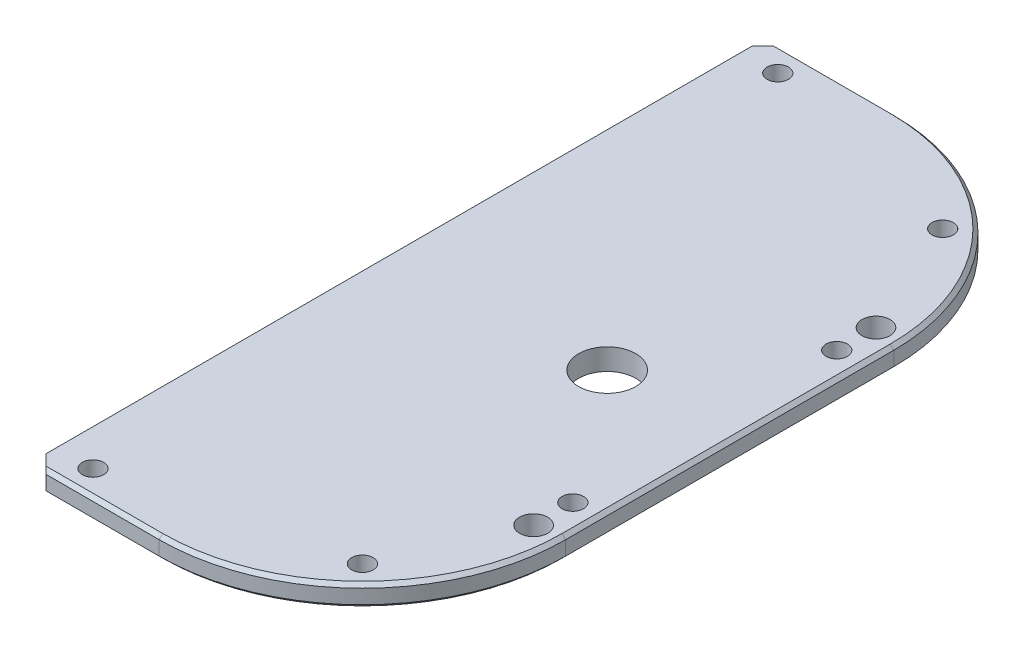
ISO-10303-21;
HEADER;
FILE_DESCRIPTION(('STEP AP214'),'2;1');
FILE_NAME('part.step','',(''),(''),'','','');
FILE_SCHEMA(('AUTOMOTIVE_DESIGN { 1 0 10303 214 1 1 1 1 }'));
ENDSEC;
DATA;
#1=APPLICATION_CONTEXT('core data for automotive mechanical design processes');
#2=APPLICATION_PROTOCOL_DEFINITION('international standard','automotive_design',2000,#1);
#3=PRODUCT_CONTEXT('',#1,'mechanical');
#4=PRODUCT('Part','Part','',(#3));
#5=PRODUCT_RELATED_PRODUCT_CATEGORY('part','',(#4));
#6=PRODUCT_DEFINITION_FORMATION('','',#4);
#7=PRODUCT_DEFINITION_CONTEXT('part definition',#1,'design');
#8=PRODUCT_DEFINITION('design','',#6,#7);
#9=PRODUCT_DEFINITION_SHAPE('','',#8);
#10=(LENGTH_UNIT() NAMED_UNIT(*) SI_UNIT(.MILLI.,.METRE.));
#11=(NAMED_UNIT(*) PLANE_ANGLE_UNIT() SI_UNIT($,.RADIAN.));
#12=(NAMED_UNIT(*) SI_UNIT($,.STERADIAN.) SOLID_ANGLE_UNIT());
#13=UNCERTAINTY_MEASURE_WITH_UNIT(LENGTH_MEASURE(1.E-05),#10,'distance_accuracy_value','');
#14=(GEOMETRIC_REPRESENTATION_CONTEXT(3) GLOBAL_UNCERTAINTY_ASSIGNED_CONTEXT((#13)) GLOBAL_UNIT_ASSIGNED_CONTEXT((#10,
#11,#12)) REPRESENTATION_CONTEXT('',''));
#15=CARTESIAN_POINT('',(0.,0.,0.));
#16=DIRECTION('',(0.,0.,1.));
#17=DIRECTION('',(1.,0.,0.));
#18=AXIS2_PLACEMENT_3D('',#15,#16,#17);
#19=CARTESIAN_POINT('',(0.,-4.7625,0.));
#20=DIRECTION('',(0.,1.,0.));
#21=DIRECTION('',(0.,0.,1.));
#22=AXIS2_PLACEMENT_3D('',#19,#20,#21);
#23=PLANE('',#22);
#24=CARTESIAN_POINT('',(21.7841139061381,-4.7625,-76.2000000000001));
#25=DIRECTION('',(0.,1.,0.));
#26=DIRECTION('',(0.,0.,1.));
#27=AXIS2_PLACEMENT_3D('',#24,#25,#26);
#28=CIRCLE('',#27,6.24999999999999);
#29=CARTESIAN_POINT('',(21.7841139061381,-4.7625,-69.9500000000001));
#30=VERTEX_POINT('',#29);
#31=EDGE_CURVE('E349',#30,#30,#28,.T.);
#32=ORIENTED_EDGE('',*,*,#31,.T.);
#33=EDGE_LOOP('',(#32));
#34=FACE_BOUND('',#33,.T.);
#35=CARTESIAN_POINT('',(21.7841139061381,-4.7625,76.2));
#36=DIRECTION('',(0.,1.,0.));
#37=DIRECTION('',(0.,0.,1.));
#38=AXIS2_PLACEMENT_3D('',#35,#36,#37);
#39=CIRCLE('',#38,6.24999999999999);
#40=CARTESIAN_POINT('',(21.7841139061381,-4.7625,82.45));
#41=VERTEX_POINT('',#40);
#42=EDGE_CURVE('E257',#41,#41,#39,.T.);
#43=ORIENTED_EDGE('',*,*,#42,.T.);
#44=EDGE_LOOP('',(#43));
#45=FACE_BOUND('',#44,.T.);
#46=CARTESIAN_POINT('',(-98.1356360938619,-4.7625,152.4));
#47=DIRECTION('',(0.,1.,0.));
#48=DIRECTION('',(0.,0.,1.));
#49=AXIS2_PLACEMENT_3D('',#46,#47,#48);
#50=CIRCLE('',#49,4.76250000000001);
#51=CARTESIAN_POINT('',(-98.1356360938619,-4.7625,157.1625));
#52=VERTEX_POINT('',#51);
#53=EDGE_CURVE('E339',#52,#52,#50,.T.);
#54=ORIENTED_EDGE('',*,*,#53,.T.);
#55=EDGE_LOOP('',(#54));
#56=FACE_BOUND('',#55,.T.);
#57=CARTESIAN_POINT('',(-1.46428533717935,-4.7625,129.151600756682));
#58=DIRECTION('',(0.,1.,0.));
#59=DIRECTION('',(0.,0.,1.));
#60=AXIS2_PLACEMENT_3D('',#57,#58,#59);
#61=CIRCLE('',#60,4.76250000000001);
#62=CARTESIAN_POINT('',(-1.46428533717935,-4.7625,133.914100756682));
#63=VERTEX_POINT('',#62);
#64=EDGE_CURVE('E333',#63,#63,#61,.T.);
#65=ORIENTED_EDGE('',*,*,#64,.T.);
#66=EDGE_LOOP('',(#65));
#67=FACE_BOUND('',#66,.T.);
#68=CARTESIAN_POINT('',(21.7841139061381,-4.7625,58.7375));
#69=DIRECTION('',(0.,1.,0.));
#70=DIRECTION('',(0.,0.,1.));
#71=AXIS2_PLACEMENT_3D('',#68,#69,#70);
#72=CIRCLE('',#71,4.76250000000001);
#73=CARTESIAN_POINT('',(21.7841139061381,-4.7625,63.5));
#74=VERTEX_POINT('',#73);
#75=EDGE_CURVE('E327',#74,#74,#72,.T.);
#76=ORIENTED_EDGE('',*,*,#75,.T.);
#77=EDGE_LOOP('',(#76));
#78=FACE_BOUND('',#77,.T.);
#79=CARTESIAN_POINT('',(21.7841139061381,-4.7625,-58.7375));
#80=DIRECTION('',(0.,1.,0.));
#81=DIRECTION('',(0.,0.,1.));
#82=AXIS2_PLACEMENT_3D('',#79,#80,#81);
#83=CIRCLE('',#82,4.76250000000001);
#84=CARTESIAN_POINT('',(21.7841139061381,-4.7625,-53.975));
#85=VERTEX_POINT('',#84);
#86=EDGE_CURVE('E321',#85,#85,#83,.T.);
#87=ORIENTED_EDGE('',*,*,#86,.T.);
#88=EDGE_LOOP('',(#87));
#89=FACE_BOUND('',#88,.T.);
#90=CARTESIAN_POINT('',(-1.46428533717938,-4.7625,-129.151600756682));
#91=DIRECTION('',(0.,1.,0.));
#92=DIRECTION('',(0.,0.,1.));
#93=AXIS2_PLACEMENT_3D('',#90,#91,#92);
#94=CIRCLE('',#93,4.76250000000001);
#95=CARTESIAN_POINT('',(-1.46428533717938,-4.7625,-124.389100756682));
#96=VERTEX_POINT('',#95);
#97=EDGE_CURVE('E315',#96,#96,#94,.T.);
#98=ORIENTED_EDGE('',*,*,#97,.T.);
#99=EDGE_LOOP('',(#98));
#100=FACE_BOUND('',#99,.T.);
#101=CARTESIAN_POINT('',(-98.1356360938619,-4.7625,-152.4));
#102=DIRECTION('',(0.,1.,0.));
#103=DIRECTION('',(0.,0.,1.));
#104=AXIS2_PLACEMENT_3D('',#101,#102,#103);
#105=CIRCLE('',#104,4.76250000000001);
#106=CARTESIAN_POINT('',(-98.1356360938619,-4.7625,-147.6375));
#107=VERTEX_POINT('',#106);
#108=EDGE_CURVE('E204',#107,#107,#105,.T.);
#109=ORIENTED_EDGE('',*,*,#108,.T.);
#110=EDGE_LOOP('',(#109));
#111=FACE_BOUND('',#110,.T.);
#112=CARTESIAN_POINT('',(-21.6462721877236,-4.7625,3.14409156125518E-13));
#113=DIRECTION('',(0.,1.,0.));
#114=DIRECTION('',(0.,0.,1.));
#115=AXIS2_PLACEMENT_3D('',#112,#113,#114);
#116=CIRCLE('',#115,12.7);
#117=CARTESIAN_POINT('',(-21.6462721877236,-4.7625,12.7000000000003));
#118=VERTEX_POINT('',#117);
#119=EDGE_CURVE('E305',#118,#118,#116,.T.);
#120=ORIENTED_EDGE('',*,*,#119,.T.);
#121=EDGE_LOOP('',(#120));
#122=FACE_BOUND('',#121,.T.);
#123=DIRECTION('',(-1.,0.,0.));
#124=VECTOR('',#123,1.);
#125=CARTESIAN_POINT('',(-114.3,-4.7625,161.925));
#126=LINE('',#125,#124);
#127=CARTESIAN_POINT('',(-57.5908860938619,-4.7625,161.925));
#128=VERTEX_POINT('',#127);
#129=CARTESIAN_POINT('',(-109.5375,-4.7625,161.925));
#130=VERTEX_POINT('',#129);
#131=EDGE_CURVE('E177',#128,#130,#126,.T.);
#132=ORIENTED_EDGE('',*,*,#131,.T.);
#133=DIRECTION('',(0.707106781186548,0.,0.707106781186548));
#134=VECTOR('',#133,1.);
#135=CARTESIAN_POINT('',(-114.3,-4.7625,157.1625));
#136=LINE('',#135,#134);
#137=CARTESIAN_POINT('',(-114.3,-4.7625,157.1625));
#138=VERTEX_POINT('',#137);
#139=EDGE_CURVE('E280',#130,#138,#136,.F.);
#140=ORIENTED_EDGE('',*,*,#139,.T.);
#141=DIRECTION('',(0.,0.,1.));
#142=VECTOR('',#141,1.);
#143=CARTESIAN_POINT('',(-114.3,-4.7625,161.925));
#144=LINE('',#143,#142);
#145=CARTESIAN_POINT('',(-114.3,-4.7625,-157.1625));
#146=VERTEX_POINT('',#145);
#147=EDGE_CURVE('E196',#146,#138,#144,.T.);
#148=ORIENTED_EDGE('',*,*,#147,.F.);
#149=DIRECTION('',(-0.707106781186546,0.,0.707106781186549));
#150=VECTOR('',#149,1.);
#151=CARTESIAN_POINT('',(-107.95,-4.7625,-163.5125));
#152=LINE('',#151,#150);
#153=CARTESIAN_POINT('',(-109.5375,-4.7625,-161.925));
#154=VERTEX_POINT('',#153);
#155=EDGE_CURVE('E278',#146,#154,#152,.F.);
#156=ORIENTED_EDGE('',*,*,#155,.T.);
#157=DIRECTION('',(1.,0.,0.));
#158=VECTOR('',#157,1.);
#159=CARTESIAN_POINT('',(-57.5908860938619,-4.7625,-161.925));
#160=LINE('',#159,#158);
#161=CARTESIAN_POINT('',(-57.5908860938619,-4.7625,-161.925));
#162=VERTEX_POINT('',#161);
#163=EDGE_CURVE('E168',#154,#162,#160,.T.);
#164=ORIENTED_EDGE('',*,*,#163,.T.);
#165=CARTESIAN_POINT('',(-57.5908860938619,-4.7625,-73.025));
#166=DIRECTION('',(0.,1.,0.));
#167=DIRECTION('',(0.,0.,1.));
#168=AXIS2_PLACEMENT_3D('',#165,#166,#167);
#169=CIRCLE('',#168,88.9);
#170=CARTESIAN_POINT('',(31.3091139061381,-4.7625,-73.025));
#171=VERTEX_POINT('',#170);
#172=EDGE_CURVE('E214',#162,#171,#169,.F.);
#173=ORIENTED_EDGE('',*,*,#172,.T.);
#174=DIRECTION('',(0.,0.,1.));
#175=VECTOR('',#174,1.);
#176=CARTESIAN_POINT('',(31.3091139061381,-4.7625,73.025));
#177=LINE('',#176,#175);
#178=CARTESIAN_POINT('',(31.3091139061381,-4.7625,73.025));
#179=VERTEX_POINT('',#178);
#180=EDGE_CURVE('E216',#171,#179,#177,.T.);
#181=ORIENTED_EDGE('',*,*,#180,.T.);
#182=CARTESIAN_POINT('',(-57.5908860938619,-4.7625,73.025));
#183=DIRECTION('',(0.,1.,0.));
#184=DIRECTION('',(0.,0.,1.));
#185=AXIS2_PLACEMENT_3D('',#182,#183,#184);
#186=CIRCLE('',#185,88.9);
#187=EDGE_CURVE('E218',#179,#128,#186,.F.);
#188=ORIENTED_EDGE('',*,*,#187,.T.);
#189=EDGE_LOOP('',(#132,#140,#148,#156,#164,#173,#181,#188));
#190=FACE_BOUND('',#189,.T.);
#191=ADVANCED_FACE('F56',(#34,#45,#56,#67,#78,#89,#100,#111,#122,#190),#23,.F.);
#192=CARTESIAN_POINT('',(-57.5908860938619,-4.7625,-163.5125));
#193=DIRECTION('',(0.,0.,-1.));
#194=DIRECTION('',(-1.,0.,0.));
#195=AXIS2_PLACEMENT_3D('',#192,#193,#194);
#196=PLANE('',#195);
#197=DIRECTION('',(-1.,0.,0.));
#198=VECTOR('',#197,1.);
#199=CARTESIAN_POINT('',(-114.3,-3.17499999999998,-163.5125));
#200=LINE('',#199,#198);
#201=CARTESIAN_POINT('',(-57.5908860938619,-3.17499999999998,-163.5125));
#202=VERTEX_POINT('',#201);
#203=CARTESIAN_POINT('',(-107.95,-3.17499999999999,-163.5125));
#204=VERTEX_POINT('',#203);
#205=EDGE_CURVE('E231',#202,#204,#200,.T.);
#206=ORIENTED_EDGE('',*,*,#205,.T.);
#207=DIRECTION('',(0.,1.,0.));
#208=VECTOR('',#207,1.);
#209=CARTESIAN_POINT('',(-107.95,-4.7625,-163.5125));
#210=LINE('',#209,#208);
#211=CARTESIAN_POINT('',(-107.95,3.17499999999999,-163.5125));
#212=VERTEX_POINT('',#211);
#213=EDGE_CURVE('E282',#204,#212,#210,.T.);
#214=ORIENTED_EDGE('',*,*,#213,.T.);
#215=DIRECTION('',(1.,0.,0.));
#216=VECTOR('',#215,1.);
#217=CARTESIAN_POINT('',(-57.5908860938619,3.17499999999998,-163.5125));
#218=LINE('',#217,#216);
#219=CARTESIAN_POINT('',(-57.5908860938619,3.17499999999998,-163.5125));
#220=VERTEX_POINT('',#219);
#221=EDGE_CURVE('E229',#212,#220,#218,.T.);
#222=ORIENTED_EDGE('',*,*,#221,.T.);
#223=DIRECTION('',(0.,1.,0.));
#224=VECTOR('',#223,1.);
#225=CARTESIAN_POINT('',(-57.5908860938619,-4.7625,-163.5125));
#226=LINE('',#225,#224);
#227=EDGE_CURVE('E209',#202,#220,#226,.T.);
#228=ORIENTED_EDGE('',*,*,#227,.F.);
#229=EDGE_LOOP('',(#206,#214,#222,#228));
#230=FACE_BOUND('',#229,.T.);
#231=ADVANCED_FACE('F391',(#230),#196,.T.);
#232=CARTESIAN_POINT('',(-57.5908860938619,-4.7625,-73.025));
#233=DIRECTION('',(0.,1.,0.));
#234=DIRECTION('',(0.,0.,1.));
#235=AXIS2_PLACEMENT_3D('',#232,#233,#234);
#236=CYLINDRICAL_SURFACE('',#235,90.4875);
#237=DIRECTION('',(0.,1.,0.));
#238=VECTOR('',#237,1.);
#239=CARTESIAN_POINT('',(32.8966139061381,-4.7625,-73.025));
#240=LINE('',#239,#238);
#241=CARTESIAN_POINT('',(32.8966139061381,-3.17499999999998,-73.025));
#242=VERTEX_POINT('',#241);
#243=CARTESIAN_POINT('',(32.8966139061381,3.17499999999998,-73.025));
#244=VERTEX_POINT('',#243);
#245=EDGE_CURVE('E198',#242,#244,#240,.T.);
#246=ORIENTED_EDGE('',*,*,#245,.F.);
#247=CARTESIAN_POINT('',(-57.5908860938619,-3.17499999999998,-73.025));
#248=DIRECTION('',(0.,1.,0.));
#249=DIRECTION('',(0.,0.,1.));
#250=AXIS2_PLACEMENT_3D('',#247,#248,#249);
#251=CIRCLE('',#250,90.4875);
#252=EDGE_CURVE('E227',#242,#202,#251,.T.);
#253=ORIENTED_EDGE('',*,*,#252,.T.);
#254=ORIENTED_EDGE('',*,*,#227,.T.);
#255=CARTESIAN_POINT('',(-57.5908860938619,3.17499999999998,-73.025));
#256=DIRECTION('',(0.,1.,0.));
#257=DIRECTION('',(0.,0.,1.));
#258=AXIS2_PLACEMENT_3D('',#255,#256,#257);
#259=CIRCLE('',#258,90.4875);
#260=EDGE_CURVE('E225',#220,#244,#259,.F.);
#261=ORIENTED_EDGE('',*,*,#260,.T.);
#262=EDGE_LOOP('',(#246,#253,#254,#261));
#263=FACE_BOUND('',#262,.T.);
#264=ADVANCED_FACE('F397',(#263),#236,.T.);
#265=CARTESIAN_POINT('',(32.8966139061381,-4.7625,73.025));
#266=DIRECTION('',(1.,0.,0.));
#267=DIRECTION('',(0.,0.,-1.));
#268=AXIS2_PLACEMENT_3D('',#265,#266,#267);
#269=PLANE('',#268);
#270=DIRECTION('',(0.,1.,0.));
#271=VECTOR('',#270,1.);
#272=CARTESIAN_POINT('',(32.8966139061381,-4.7625,73.025));
#273=LINE('',#272,#271);
#274=CARTESIAN_POINT('',(32.8966139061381,-3.17499999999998,73.025));
#275=VERTEX_POINT('',#274);
#276=CARTESIAN_POINT('',(32.8966139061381,3.17499999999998,73.025));
#277=VERTEX_POINT('',#276);
#278=EDGE_CURVE('E195',#275,#277,#273,.T.);
#279=ORIENTED_EDGE('',*,*,#278,.F.);
#280=DIRECTION('',(0.,0.,-1.));
#281=VECTOR('',#280,1.);
#282=CARTESIAN_POINT('',(32.8966139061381,-3.17499999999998,-73.025));
#283=LINE('',#282,#281);
#284=EDGE_CURVE('E223',#275,#242,#283,.T.);
#285=ORIENTED_EDGE('',*,*,#284,.T.);
#286=ORIENTED_EDGE('',*,*,#245,.T.);
#287=DIRECTION('',(0.,0.,1.));
#288=VECTOR('',#287,1.);
#289=CARTESIAN_POINT('',(32.8966139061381,3.17499999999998,73.025));
#290=LINE('',#289,#288);
#291=EDGE_CURVE('E190',#244,#277,#290,.T.);
#292=ORIENTED_EDGE('',*,*,#291,.T.);
#293=EDGE_LOOP('',(#279,#285,#286,#292));
#294=FACE_BOUND('',#293,.T.);
#295=ADVANCED_FACE('F406',(#294),#269,.T.);
#296=CARTESIAN_POINT('',(-57.5908860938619,-4.7625,73.025));
#297=DIRECTION('',(0.,1.,0.));
#298=DIRECTION('',(0.,0.,1.));
#299=AXIS2_PLACEMENT_3D('',#296,#297,#298);
#300=CYLINDRICAL_SURFACE('',#299,90.4875);
#301=DIRECTION('',(0.,1.,0.));
#302=VECTOR('',#301,1.);
#303=CARTESIAN_POINT('',(-57.5908860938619,-4.7625,163.5125));
#304=LINE('',#303,#302);
#305=CARTESIAN_POINT('',(-57.5908860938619,-3.17499999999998,163.5125));
#306=VERTEX_POINT('',#305);
#307=CARTESIAN_POINT('',(-57.5908860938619,3.17499999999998,163.5125));
#308=VERTEX_POINT('',#307);
#309=EDGE_CURVE('E162',#306,#308,#304,.T.);
#310=ORIENTED_EDGE('',*,*,#309,.F.);
#311=CARTESIAN_POINT('',(-57.5908860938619,-3.17499999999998,73.025));
#312=DIRECTION('',(0.,1.,0.));
#313=DIRECTION('',(0.,0.,1.));
#314=AXIS2_PLACEMENT_3D('',#311,#312,#313);
#315=CIRCLE('',#314,90.4875);
#316=EDGE_CURVE('E184',#306,#275,#315,.T.);
#317=ORIENTED_EDGE('',*,*,#316,.T.);
#318=ORIENTED_EDGE('',*,*,#278,.T.);
#319=CARTESIAN_POINT('',(-57.5908860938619,3.17499999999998,73.025));
#320=DIRECTION('',(0.,1.,0.));
#321=DIRECTION('',(0.,0.,1.));
#322=AXIS2_PLACEMENT_3D('',#319,#320,#321);
#323=CIRCLE('',#322,90.4875);
#324=EDGE_CURVE('E191',#277,#308,#323,.F.);
#325=ORIENTED_EDGE('',*,*,#324,.T.);
#326=EDGE_LOOP('',(#310,#317,#318,#325));
#327=FACE_BOUND('',#326,.T.);
#328=ADVANCED_FACE('F193',(#327),#300,.T.);
#329=CARTESIAN_POINT('',(-114.3,-4.7625,163.5125));
#330=DIRECTION('',(0.,0.,1.));
#331=DIRECTION('',(1.,0.,0.));
#332=AXIS2_PLACEMENT_3D('',#329,#330,#331);
#333=PLANE('',#332);
#334=DIRECTION('',(-1.,0.,0.));
#335=VECTOR('',#334,1.);
#336=CARTESIAN_POINT('',(-114.3,3.17499999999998,163.5125));
#337=LINE('',#336,#335);
#338=CARTESIAN_POINT('',(-107.95,3.17499999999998,163.5125));
#339=VERTEX_POINT('',#338);
#340=EDGE_CURVE('E169',#308,#339,#337,.T.);
#341=ORIENTED_EDGE('',*,*,#340,.T.);
#342=DIRECTION('',(0.,-1.,0.));
#343=VECTOR('',#342,1.);
#344=CARTESIAN_POINT('',(-107.95,-4.7625,163.5125));
#345=LINE('',#344,#343);
#346=CARTESIAN_POINT('',(-107.95,-3.17499999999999,163.5125));
#347=VERTEX_POINT('',#346);
#348=EDGE_CURVE('E165',#339,#347,#345,.T.);
#349=ORIENTED_EDGE('',*,*,#348,.T.);
#350=DIRECTION('',(1.,0.,0.));
#351=VECTOR('',#350,1.);
#352=CARTESIAN_POINT('',(-57.5908860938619,-3.17499999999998,163.5125));
#353=LINE('',#352,#351);
#354=EDGE_CURVE('E157',#347,#306,#353,.T.);
#355=ORIENTED_EDGE('',*,*,#354,.T.);
#356=ORIENTED_EDGE('',*,*,#309,.T.);
#357=EDGE_LOOP('',(#341,#349,#355,#356));
#358=FACE_BOUND('',#357,.T.);
#359=ADVANCED_FACE('F160',(#358),#333,.T.);
#360=CARTESIAN_POINT('',(-114.3,-4.7625,161.925));
#361=DIRECTION('',(-1.,0.,0.));
#362=DIRECTION('',(0.,0.,1.));
#363=AXIS2_PLACEMENT_3D('',#360,#361,#362);
#364=PLANE('',#363);
#365=ORIENTED_EDGE('',*,*,#147,.T.);
#366=DIRECTION('',(0.,1.,0.));
#367=VECTOR('',#366,1.);
#368=CARTESIAN_POINT('',(-114.3,-4.7625,157.1625));
#369=LINE('',#368,#367);
#370=CARTESIAN_POINT('',(-114.3,4.7625,157.1625));
#371=VERTEX_POINT('',#370);
#372=EDGE_CURVE('E266',#138,#371,#369,.T.);
#373=ORIENTED_EDGE('',*,*,#372,.T.);
#374=DIRECTION('',(0.,0.,1.));
#375=VECTOR('',#374,1.);
#376=CARTESIAN_POINT('',(-114.3,4.7625,161.925));
#377=LINE('',#376,#375);
#378=CARTESIAN_POINT('',(-114.3,4.7625,-157.1625));
#379=VERTEX_POINT('',#378);
#380=EDGE_CURVE('E201',#379,#371,#377,.T.);
#381=ORIENTED_EDGE('',*,*,#380,.F.);
#382=DIRECTION('',(0.,-1.,0.));
#383=VECTOR('',#382,1.);
#384=CARTESIAN_POINT('',(-114.3,-4.7625,-157.1625));
#385=LINE('',#384,#383);
#386=EDGE_CURVE('E243',#379,#146,#385,.T.);
#387=ORIENTED_EDGE('',*,*,#386,.T.);
#388=EDGE_LOOP('',(#365,#373,#381,#387));
#389=FACE_BOUND('',#388,.T.);
#390=ADVANCED_FACE('F297',(#389),#364,.T.);
#391=CARTESIAN_POINT('',(0.,4.7625,0.));
#392=DIRECTION('',(0.,1.,0.));
#393=DIRECTION('',(0.,0.,1.));
#394=AXIS2_PLACEMENT_3D('',#391,#392,#393);
#395=PLANE('',#394);
#396=CARTESIAN_POINT('',(21.7841139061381,4.7625,-76.2000000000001));
#397=DIRECTION('',(0.,1.,0.));
#398=DIRECTION('',(0.,0.,1.));
#399=AXIS2_PLACEMENT_3D('',#396,#397,#398);
#400=CIRCLE('',#399,6.24999999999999);
#401=CARTESIAN_POINT('',(21.7841139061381,4.7625,-69.9500000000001));
#402=VERTEX_POINT('',#401);
#403=EDGE_CURVE('E352',#402,#402,#400,.T.);
#404=ORIENTED_EDGE('',*,*,#403,.F.);
#405=EDGE_LOOP('',(#404));
#406=FACE_BOUND('',#405,.T.);
#407=CARTESIAN_POINT('',(21.7841139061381,4.7625,76.2));
#408=DIRECTION('',(0.,1.,0.));
#409=DIRECTION('',(0.,0.,1.));
#410=AXIS2_PLACEMENT_3D('',#407,#408,#409);
#411=CIRCLE('',#410,6.24999999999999);
#412=CARTESIAN_POINT('',(21.7841139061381,4.7625,82.45));
#413=VERTEX_POINT('',#412);
#414=EDGE_CURVE('E346',#413,#413,#411,.T.);
#415=ORIENTED_EDGE('',*,*,#414,.F.);
#416=EDGE_LOOP('',(#415));
#417=FACE_BOUND('',#416,.T.);
#418=CARTESIAN_POINT('',(-98.1356360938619,4.7625,152.4));
#419=DIRECTION('',(0.,1.,0.));
#420=DIRECTION('',(0.,0.,1.));
#421=AXIS2_PLACEMENT_3D('',#418,#419,#420);
#422=CIRCLE('',#421,4.76250000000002);
#423=CARTESIAN_POINT('',(-98.1356360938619,4.7625,157.1625));
#424=VERTEX_POINT('',#423);
#425=EDGE_CURVE('E252',#424,#424,#422,.T.);
#426=ORIENTED_EDGE('',*,*,#425,.F.);
#427=EDGE_LOOP('',(#426));
#428=FACE_BOUND('',#427,.T.);
#429=CARTESIAN_POINT('',(-1.46428533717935,4.7625,129.151600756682));
#430=DIRECTION('',(0.,1.,0.));
#431=DIRECTION('',(0.,0.,1.));
#432=AXIS2_PLACEMENT_3D('',#429,#430,#431);
#433=CIRCLE('',#432,4.76250000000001);
#434=CARTESIAN_POINT('',(-1.46428533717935,4.7625,133.914100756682));
#435=VERTEX_POINT('',#434);
#436=EDGE_CURVE('E336',#435,#435,#433,.T.);
#437=ORIENTED_EDGE('',*,*,#436,.F.);
#438=EDGE_LOOP('',(#437));
#439=FACE_BOUND('',#438,.T.);
#440=CARTESIAN_POINT('',(21.7841139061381,4.7625,58.7375));
#441=DIRECTION('',(0.,1.,0.));
#442=DIRECTION('',(0.,0.,1.));
#443=AXIS2_PLACEMENT_3D('',#440,#441,#442);
#444=CIRCLE('',#443,4.76250000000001);
#445=CARTESIAN_POINT('',(21.7841139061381,4.7625,63.5));
#446=VERTEX_POINT('',#445);
#447=EDGE_CURVE('E330',#446,#446,#444,.T.);
#448=ORIENTED_EDGE('',*,*,#447,.F.);
#449=EDGE_LOOP('',(#448));
#450=FACE_BOUND('',#449,.T.);
#451=CARTESIAN_POINT('',(21.7841139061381,4.7625,-58.7375));
#452=DIRECTION('',(0.,1.,0.));
#453=DIRECTION('',(0.,0.,1.));
#454=AXIS2_PLACEMENT_3D('',#451,#452,#453);
#455=CIRCLE('',#454,4.76250000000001);
#456=CARTESIAN_POINT('',(21.7841139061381,4.7625,-53.975));
#457=VERTEX_POINT('',#456);
#458=EDGE_CURVE('E324',#457,#457,#455,.T.);
#459=ORIENTED_EDGE('',*,*,#458,.F.);
#460=EDGE_LOOP('',(#459));
#461=FACE_BOUND('',#460,.T.);
#462=CARTESIAN_POINT('',(-1.46428533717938,4.7625,-129.151600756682));
#463=DIRECTION('',(0.,1.,0.));
#464=DIRECTION('',(0.,0.,1.));
#465=AXIS2_PLACEMENT_3D('',#462,#463,#464);
#466=CIRCLE('',#465,4.76250000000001);
#467=CARTESIAN_POINT('',(-1.46428533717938,4.7625,-124.389100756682));
#468=VERTEX_POINT('',#467);
#469=EDGE_CURVE('E318',#468,#468,#466,.T.);
#470=ORIENTED_EDGE('',*,*,#469,.F.);
#471=EDGE_LOOP('',(#470));
#472=FACE_BOUND('',#471,.T.);
#473=CARTESIAN_POINT('',(-98.1356360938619,4.7625,-152.4));
#474=DIRECTION('',(0.,1.,0.));
#475=DIRECTION('',(0.,0.,1.));
#476=AXIS2_PLACEMENT_3D('',#473,#474,#475);
#477=CIRCLE('',#476,4.76250000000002);
#478=CARTESIAN_POINT('',(-98.1356360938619,4.7625,-147.6375));
#479=VERTEX_POINT('',#478);
#480=EDGE_CURVE('E312',#479,#479,#477,.T.);
#481=ORIENTED_EDGE('',*,*,#480,.F.);
#482=EDGE_LOOP('',(#481));
#483=FACE_BOUND('',#482,.T.);
#484=CARTESIAN_POINT('',(-21.6462721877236,4.7625,3.14409156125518E-13));
#485=DIRECTION('',(0.,1.,0.));
#486=DIRECTION('',(0.,0.,1.));
#487=AXIS2_PLACEMENT_3D('',#484,#485,#486);
#488=CIRCLE('',#487,12.7);
#489=CARTESIAN_POINT('',(-21.6462721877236,4.7625,12.7000000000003));
#490=VERTEX_POINT('',#489);
#491=EDGE_CURVE('E307',#490,#490,#488,.T.);
#492=ORIENTED_EDGE('',*,*,#491,.F.);
#493=EDGE_LOOP('',(#492));
#494=FACE_BOUND('',#493,.T.);
#495=ORIENTED_EDGE('',*,*,#380,.T.);
#496=DIRECTION('',(-0.707106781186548,0.,-0.707106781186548));
#497=VECTOR('',#496,1.);
#498=CARTESIAN_POINT('',(-135.73125,4.7625,135.73125));
#499=LINE('',#498,#497);
#500=CARTESIAN_POINT('',(-109.5375,4.76250000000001,161.925));
#501=VERTEX_POINT('',#500);
#502=EDGE_CURVE('E271',#371,#501,#499,.F.);
#503=ORIENTED_EDGE('',*,*,#502,.T.);
#504=DIRECTION('',(1.,0.,0.));
#505=VECTOR('',#504,1.);
#506=CARTESIAN_POINT('',(-3.17008767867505E-13,4.7625,161.925));
#507=LINE('',#506,#505);
#508=CARTESIAN_POINT('',(-57.5908860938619,4.7625,161.925));
#509=VERTEX_POINT('',#508);
#510=EDGE_CURVE('E242',#501,#509,#507,.T.);
#511=ORIENTED_EDGE('',*,*,#510,.T.);
#512=CARTESIAN_POINT('',(-57.5908860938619,4.7625,73.025));
#513=DIRECTION('',(0.,1.,0.));
#514=DIRECTION('',(0.,0.,1.));
#515=AXIS2_PLACEMENT_3D('',#512,#513,#514);
#516=CIRCLE('',#515,88.9);
#517=CARTESIAN_POINT('',(31.3091139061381,4.7625,73.025));
#518=VERTEX_POINT('',#517);
#519=EDGE_CURVE('E240',#509,#518,#516,.T.);
#520=ORIENTED_EDGE('',*,*,#519,.T.);
#521=DIRECTION('',(0.,0.,-1.));
#522=VECTOR('',#521,1.);
#523=CARTESIAN_POINT('',(31.3091139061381,4.7625,0.));
#524=LINE('',#523,#522);
#525=CARTESIAN_POINT('',(31.3091139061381,4.7625,-73.025));
#526=VERTEX_POINT('',#525);
#527=EDGE_CURVE('E238',#518,#526,#524,.T.);
#528=ORIENTED_EDGE('',*,*,#527,.T.);
#529=CARTESIAN_POINT('',(-57.5908860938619,4.7625,-73.025));
#530=DIRECTION('',(0.,1.,0.));
#531=DIRECTION('',(0.,0.,1.));
#532=AXIS2_PLACEMENT_3D('',#529,#530,#531);
#533=CIRCLE('',#532,88.9);
#534=CARTESIAN_POINT('',(-57.5908860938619,4.7625,-161.925));
#535=VERTEX_POINT('',#534);
#536=EDGE_CURVE('E236',#526,#535,#533,.T.);
#537=ORIENTED_EDGE('',*,*,#536,.T.);
#538=DIRECTION('',(-1.,0.,0.));
#539=VECTOR('',#538,1.);
#540=CARTESIAN_POINT('',(-3.17008767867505E-13,4.7625,-161.925));
#541=LINE('',#540,#539);
#542=CARTESIAN_POINT('',(-109.5375,4.7625,-161.925));
#543=VERTEX_POINT('',#542);
#544=EDGE_CURVE('E233',#535,#543,#541,.T.);
#545=ORIENTED_EDGE('',*,*,#544,.T.);
#546=DIRECTION('',(0.707106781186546,0.,-0.707106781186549));
#547=VECTOR('',#546,1.);
#548=CARTESIAN_POINT('',(-135.73125,4.7625,-135.73125));
#549=LINE('',#548,#547);
#550=EDGE_CURVE('E269',#543,#379,#549,.F.);
#551=ORIENTED_EDGE('',*,*,#550,.T.);
#552=EDGE_LOOP('',(#495,#503,#511,#520,#528,#537,#545,#551));
#553=FACE_BOUND('',#552,.T.);
#554=ADVANCED_FACE('F290',(#406,#417,#428,#439,#450,#461,#472,#483,#494,#553),#395,.T.);
#555=CARTESIAN_POINT('',(-21.6462721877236,-4.7625,3.14409156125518E-13));
#556=DIRECTION('',(0.,1.,0.));
#557=DIRECTION('',(0.,0.,1.));
#558=AXIS2_PLACEMENT_3D('',#555,#556,#557);
#559=CYLINDRICAL_SURFACE('',#558,12.7);
#560=CARTESIAN_POINT('',(-21.6462721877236,-4.7625,12.7000000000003));
#561=CARTESIAN_POINT('',(-21.6462721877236,-4.66328125,12.7000000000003));
#562=CARTESIAN_POINT('',(-21.6462721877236,-4.5640625,12.7000000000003));
#563=CARTESIAN_POINT('',(-21.6462721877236,-4.365625,12.7000000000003));
#564=CARTESIAN_POINT('',(-21.6462721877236,-4.26640625,12.7000000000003));
#565=CARTESIAN_POINT('',(-21.6462721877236,-4.06796875,12.7000000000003));
#566=CARTESIAN_POINT('',(-21.6462721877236,-3.96875,12.7000000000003));
#567=CARTESIAN_POINT('',(-21.6462721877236,-3.7703125,12.7000000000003));
#568=CARTESIAN_POINT('',(-21.6462721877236,-3.67109375,12.7000000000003));
#569=CARTESIAN_POINT('',(-21.6462721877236,-3.47265625,12.7000000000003));
#570=CARTESIAN_POINT('',(-21.6462721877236,-3.3734375,12.7000000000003));
#571=CARTESIAN_POINT('',(-21.6462721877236,-3.175,12.7000000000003));
#572=CARTESIAN_POINT('',(-21.6462721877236,-3.07578125,12.7000000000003));
#573=CARTESIAN_POINT('',(-21.6462721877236,-2.87734375,12.7000000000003));
#574=CARTESIAN_POINT('',(-21.6462721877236,-2.778125,12.7000000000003));
#575=CARTESIAN_POINT('',(-21.6462721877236,-2.5796875,12.7000000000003));
#576=CARTESIAN_POINT('',(-21.6462721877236,-2.48046875,12.7000000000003));
#577=CARTESIAN_POINT('',(-21.6462721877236,-2.28203125,12.7000000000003));
#578=CARTESIAN_POINT('',(-21.6462721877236,-2.1828125,12.7000000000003));
#579=CARTESIAN_POINT('',(-21.6462721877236,-1.984375,12.7000000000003));
#580=CARTESIAN_POINT('',(-21.6462721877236,-1.88515625,12.7000000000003));
#581=CARTESIAN_POINT('',(-21.6462721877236,-1.68671875,12.7000000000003));
#582=CARTESIAN_POINT('',(-21.6462721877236,-1.5875,12.7000000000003));
#583=CARTESIAN_POINT('',(-21.6462721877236,-1.3890625,12.7000000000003));
#584=CARTESIAN_POINT('',(-21.6462721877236,-1.28984375,12.7000000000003));
#585=CARTESIAN_POINT('',(-21.6462721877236,-1.09140625,12.7000000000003));
#586=CARTESIAN_POINT('',(-21.6462721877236,-0.9921875,12.7000000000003));
#587=CARTESIAN_POINT('',(-21.6462721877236,-0.793750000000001,12.7000000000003));
#588=CARTESIAN_POINT('',(-21.6462721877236,-0.694531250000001,12.7000000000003));
#589=CARTESIAN_POINT('',(-21.6462721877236,-0.496093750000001,12.7000000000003));
#590=CARTESIAN_POINT('',(-21.6462721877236,-0.396875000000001,12.7000000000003));
#591=CARTESIAN_POINT('',(-21.6462721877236,-0.198437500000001,12.7000000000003));
#592=CARTESIAN_POINT('',(-21.6462721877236,-0.0992187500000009,12.7000000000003));
#593=CARTESIAN_POINT('',(-21.6462721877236,0.0992187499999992,12.7000000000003));
#594=CARTESIAN_POINT('',(-21.6462721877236,0.198437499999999,12.7000000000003));
#595=CARTESIAN_POINT('',(-21.6462721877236,0.396874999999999,12.7000000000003));
#596=CARTESIAN_POINT('',(-21.6462721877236,0.496093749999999,12.7000000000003));
#597=CARTESIAN_POINT('',(-21.6462721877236,0.694531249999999,12.7000000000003));
#598=CARTESIAN_POINT('',(-21.6462721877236,0.79375,12.7000000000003));
#599=CARTESIAN_POINT('',(-21.6462721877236,0.9921875,12.7000000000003));
#600=CARTESIAN_POINT('',(-21.6462721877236,1.09140625,12.7000000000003));
#601=CARTESIAN_POINT('',(-21.6462721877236,1.28984375,12.7000000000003));
#602=CARTESIAN_POINT('',(-21.6462721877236,1.3890625,12.7000000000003));
#603=CARTESIAN_POINT('',(-21.6462721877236,1.5875,12.7000000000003));
#604=CARTESIAN_POINT('',(-21.6462721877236,1.68671875,12.7000000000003));
#605=CARTESIAN_POINT('',(-21.6462721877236,1.88515625,12.7000000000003));
#606=CARTESIAN_POINT('',(-21.6462721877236,1.984375,12.7000000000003));
#607=CARTESIAN_POINT('',(-21.6462721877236,2.1828125,12.7000000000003));
#608=CARTESIAN_POINT('',(-21.6462721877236,2.28203125,12.7000000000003));
#609=CARTESIAN_POINT('',(-21.6462721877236,2.48046875,12.7000000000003));
#610=CARTESIAN_POINT('',(-21.6462721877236,2.5796875,12.7000000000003));
#611=CARTESIAN_POINT('',(-21.6462721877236,2.778125,12.7000000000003));
#612=CARTESIAN_POINT('',(-21.6462721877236,2.87734375,12.7000000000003));
#613=CARTESIAN_POINT('',(-21.6462721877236,3.07578125,12.7000000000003));
#614=CARTESIAN_POINT('',(-21.6462721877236,3.175,12.7000000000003));
#615=CARTESIAN_POINT('',(-21.6462721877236,3.3734375,12.7000000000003));
#616=CARTESIAN_POINT('',(-21.6462721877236,3.47265625,12.7000000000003));
#617=CARTESIAN_POINT('',(-21.6462721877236,3.67109375,12.7000000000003));
#618=CARTESIAN_POINT('',(-21.6462721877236,3.7703125,12.7000000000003));
#619=CARTESIAN_POINT('',(-21.6462721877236,3.96875,12.7000000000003));
#620=CARTESIAN_POINT('',(-21.6462721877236,4.06796875,12.7000000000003));
#621=CARTESIAN_POINT('',(-21.6462721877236,4.26640625,12.7000000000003));
#622=CARTESIAN_POINT('',(-21.6462721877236,4.365625,12.7000000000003));
#623=CARTESIAN_POINT('',(-21.6462721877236,4.5640625,12.7000000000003));
#624=CARTESIAN_POINT('',(-21.6462721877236,4.66328125,12.7000000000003));
#625=CARTESIAN_POINT('',(-21.6462721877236,4.7625,12.7000000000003));
#626=B_SPLINE_CURVE_WITH_KNOTS('',3,(#560,#561,#562,#563,#564,#565,#566,#567,#568,#569,#570,
#571,#572,#573,#574,#575,#576,#577,#578,#579,#580,#581,#582,#583,#584,#585,#586,#587,#588,#589,
#590,#591,#592,#593,#594,#595,#596,#597,#598,#599,#600,#601,#602,#603,#604,#605,#606,#607,#608,
#609,#610,#611,#612,#613,#614,#615,#616,#617,#618,#619,#620,#621,#622,#623,#624,#625),
.UNSPECIFIED.,.F.,.F.,(4,2,2,2,2,2,2,2,2,2,2,2,2,2,2,2,2,2,2,2,2,2,2,2,2,2,2,2,2,2,2,2,4),(0.,
0.29765625,0.5953125,0.892968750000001,1.190625,1.48828125,1.7859375,2.08359375,2.38125,
2.67890625,2.9765625,3.27421875,3.571875,3.86953125,4.1671875,4.46484375,4.7625,5.06015625,
5.3578125,5.65546875,5.953125,6.25078125,6.5484375,6.84609375,7.14375,7.44140625,7.7390625,
8.03671875,8.334375,8.63203125,8.9296875,9.22734375,9.525),.UNSPECIFIED.);
#627=EDGE_CURVE('BSEAM360',#118,#490,#626,.T.);
#628=ORIENTED_EDGE('',*,*,#119,.F.);
#629=ORIENTED_EDGE('',*,*,#491,.T.);
#630=ORIENTED_EDGE('',*,*,#627,.T.);
#631=ORIENTED_EDGE('',*,*,#627,.F.);
#632=EDGE_LOOP('',(#628,#630,#629,#631));
#633=FACE_BOUND('',#632,.T.);
#634=ADVANCED_FACE('F360',(#633),#559,.F.);
#635=CARTESIAN_POINT('',(-98.1356360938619,4.7625,-152.4));
#636=DIRECTION('',(0.,1.,0.));
#637=DIRECTION('',(0.,0.,1.));
#638=AXIS2_PLACEMENT_3D('',#635,#636,#637);
#639=CYLINDRICAL_SURFACE('',#638,4.76250000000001);
#640=ORIENTED_EDGE('',*,*,#480,.T.);
#641=EDGE_LOOP('',(#640));
#642=FACE_BOUND('',#641,.T.);
#643=ORIENTED_EDGE('',*,*,#108,.F.);
#644=EDGE_LOOP('',(#643));
#645=FACE_BOUND('',#644,.T.);
#646=ADVANCED_FACE('F379',(#642,#645),#639,.F.);
#647=CARTESIAN_POINT('',(-1.46428533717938,4.7625,-129.151600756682));
#648=DIRECTION('',(0.,1.,0.));
#649=DIRECTION('',(0.,0.,1.));
#650=AXIS2_PLACEMENT_3D('',#647,#648,#649);
#651=CYLINDRICAL_SURFACE('',#650,4.76250000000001);
#652=ORIENTED_EDGE('',*,*,#469,.T.);
#653=EDGE_LOOP('',(#652));
#654=FACE_BOUND('',#653,.T.);
#655=ORIENTED_EDGE('',*,*,#97,.F.);
#656=EDGE_LOOP('',(#655));
#657=FACE_BOUND('',#656,.T.);
#658=ADVANCED_FACE('F385',(#654,#657),#651,.F.);
#659=CARTESIAN_POINT('',(21.7841139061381,4.7625,-58.7375));
#660=DIRECTION('',(0.,1.,0.));
#661=DIRECTION('',(0.,0.,1.));
#662=AXIS2_PLACEMENT_3D('',#659,#660,#661);
#663=CYLINDRICAL_SURFACE('',#662,4.76250000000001);
#664=ORIENTED_EDGE('',*,*,#458,.T.);
#665=EDGE_LOOP('',(#664));
#666=FACE_BOUND('',#665,.T.);
#667=ORIENTED_EDGE('',*,*,#86,.F.);
#668=EDGE_LOOP('',(#667));
#669=FACE_BOUND('',#668,.T.);
#670=ADVANCED_FACE('F471',(#666,#669),#663,.F.);
#671=CARTESIAN_POINT('',(21.7841139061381,4.7625,58.7375));
#672=DIRECTION('',(0.,1.,0.));
#673=DIRECTION('',(0.,0.,1.));
#674=AXIS2_PLACEMENT_3D('',#671,#672,#673);
#675=CYLINDRICAL_SURFACE('',#674,4.76250000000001);
#676=ORIENTED_EDGE('',*,*,#447,.T.);
#677=EDGE_LOOP('',(#676));
#678=FACE_BOUND('',#677,.T.);
#679=ORIENTED_EDGE('',*,*,#75,.F.);
#680=EDGE_LOOP('',(#679));
#681=FACE_BOUND('',#680,.T.);
#682=ADVANCED_FACE('F467',(#678,#681),#675,.F.);
#683=CARTESIAN_POINT('',(-1.46428533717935,4.7625,129.151600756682));
#684=DIRECTION('',(0.,1.,0.));
#685=DIRECTION('',(0.,0.,1.));
#686=AXIS2_PLACEMENT_3D('',#683,#684,#685);
#687=CYLINDRICAL_SURFACE('',#686,4.76250000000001);
#688=ORIENTED_EDGE('',*,*,#436,.T.);
#689=EDGE_LOOP('',(#688));
#690=FACE_BOUND('',#689,.T.);
#691=ORIENTED_EDGE('',*,*,#64,.F.);
#692=EDGE_LOOP('',(#691));
#693=FACE_BOUND('',#692,.T.);
#694=ADVANCED_FACE('F463',(#690,#693),#687,.F.);
#695=CARTESIAN_POINT('',(-98.1356360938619,4.7625,152.4));
#696=DIRECTION('',(0.,1.,0.));
#697=DIRECTION('',(0.,0.,1.));
#698=AXIS2_PLACEMENT_3D('',#695,#696,#697);
#699=CYLINDRICAL_SURFACE('',#698,4.76250000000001);
#700=ORIENTED_EDGE('',*,*,#425,.T.);
#701=EDGE_LOOP('',(#700));
#702=FACE_BOUND('',#701,.T.);
#703=ORIENTED_EDGE('',*,*,#53,.F.);
#704=EDGE_LOOP('',(#703));
#705=FACE_BOUND('',#704,.T.);
#706=ADVANCED_FACE('F428',(#702,#705),#699,.F.);
#707=CARTESIAN_POINT('',(-57.5908860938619,-3.17499999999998,-163.5125));
#708=DIRECTION('',(0.,-0.707106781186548,-0.707106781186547));
#709=DIRECTION('',(1.,0.,0.));
#710=AXIS2_PLACEMENT_3D('',#707,#708,#709);
#711=PLANE('',#710);
#712=ORIENTED_EDGE('',*,*,#163,.F.);
#713=DIRECTION('',(-0.577350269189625,-0.577350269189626,0.577350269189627));
#714=VECTOR('',#713,1.);
#715=CARTESIAN_POINT('',(-91.163628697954,13.6113713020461,-180.298871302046));
#716=LINE('',#715,#714);
#717=EDGE_CURVE('E14',#154,#204,#716,.F.);
#718=ORIENTED_EDGE('',*,*,#717,.T.);
#719=ORIENTED_EDGE('',*,*,#205,.F.);
#720=DIRECTION('',(0.,0.707106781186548,-0.707106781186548));
#721=VECTOR('',#720,1.);
#722=CARTESIAN_POINT('',(-57.5908860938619,-4.7625,-161.925));
#723=LINE('',#722,#721);
#724=EDGE_CURVE('E249',#162,#202,#723,.T.);
#725=ORIENTED_EDGE('',*,*,#724,.F.);
#726=EDGE_LOOP('',(#712,#718,#719,#725));
#727=FACE_BOUND('',#726,.T.);
#728=ADVANCED_FACE('F424',(#727),#711,.T.);
#729=CARTESIAN_POINT('',(-57.5908860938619,-3.17499999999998,-73.025));
#730=DIRECTION('',(0.,1.,0.));
#731=DIRECTION('',(0.,0.,1.));
#732=AXIS2_PLACEMENT_3D('',#729,#730,#731);
#733=CONICAL_SURFACE('',#732,90.4875,0.785398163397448);
#734=ORIENTED_EDGE('',*,*,#724,.T.);
#735=ORIENTED_EDGE('',*,*,#252,.F.);
#736=DIRECTION('',(0.707106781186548,0.707106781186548,0.));
#737=VECTOR('',#736,1.);
#738=CARTESIAN_POINT('',(31.3091139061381,-4.7625,-73.025));
#739=LINE('',#738,#737);
#740=EDGE_CURVE('E246',#171,#242,#739,.T.);
#741=ORIENTED_EDGE('',*,*,#740,.F.);
#742=ORIENTED_EDGE('',*,*,#172,.F.);
#743=EDGE_LOOP('',(#734,#735,#741,#742));
#744=FACE_BOUND('',#743,.T.);
#745=ADVANCED_FACE('F420',(#744),#733,.T.);
#746=CARTESIAN_POINT('',(32.8966139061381,-3.17499999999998,73.025));
#747=DIRECTION('',(0.707106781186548,-0.707106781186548,0.));
#748=DIRECTION('',(0.,0.,1.));
#749=AXIS2_PLACEMENT_3D('',#746,#747,#748);
#750=PLANE('',#749);
#751=ORIENTED_EDGE('',*,*,#740,.T.);
#752=ORIENTED_EDGE('',*,*,#284,.F.);
#753=DIRECTION('',(0.707106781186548,0.707106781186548,0.));
#754=VECTOR('',#753,1.);
#755=CARTESIAN_POINT('',(31.3091139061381,-4.7625,73.025));
#756=LINE('',#755,#754);
#757=EDGE_CURVE('E180',#179,#275,#756,.T.);
#758=ORIENTED_EDGE('',*,*,#757,.F.);
#759=ORIENTED_EDGE('',*,*,#180,.F.);
#760=EDGE_LOOP('',(#751,#752,#758,#759));
#761=FACE_BOUND('',#760,.T.);
#762=ADVANCED_FACE('F417',(#761),#750,.T.);
#763=CARTESIAN_POINT('',(-57.5908860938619,-3.17499999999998,73.025));
#764=DIRECTION('',(0.,1.,0.));
#765=DIRECTION('',(0.,0.,1.));
#766=AXIS2_PLACEMENT_3D('',#763,#764,#765);
#767=CONICAL_SURFACE('',#766,90.4875,0.785398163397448);
#768=ORIENTED_EDGE('',*,*,#757,.T.);
#769=ORIENTED_EDGE('',*,*,#316,.F.);
#770=DIRECTION('',(0.,0.707106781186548,0.707106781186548));
#771=VECTOR('',#770,1.);
#772=CARTESIAN_POINT('',(-57.5908860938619,-4.7625,161.925));
#773=LINE('',#772,#771);
#774=EDGE_CURVE('E173',#128,#306,#773,.T.);
#775=ORIENTED_EDGE('',*,*,#774,.F.);
#776=ORIENTED_EDGE('',*,*,#187,.F.);
#777=EDGE_LOOP('',(#768,#769,#775,#776));
#778=FACE_BOUND('',#777,.T.);
#779=ADVANCED_FACE('F185',(#778),#767,.T.);
#780=CARTESIAN_POINT('',(-114.3,-3.17499999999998,163.5125));
#781=DIRECTION('',(0.,-0.707106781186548,0.707106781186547));
#782=DIRECTION('',(-1.,0.,0.));
#783=AXIS2_PLACEMENT_3D('',#780,#781,#782);
#784=PLANE('',#783);
#785=ORIENTED_EDGE('',*,*,#354,.F.);
#786=DIRECTION('',(0.577350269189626,0.577350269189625,0.577350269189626));
#787=VECTOR('',#786,1.);
#788=CARTESIAN_POINT('',(-110.066666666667,-5.29166666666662,161.395833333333));
#789=LINE('',#788,#787);
#790=EDGE_CURVE('E276',#347,#130,#789,.F.);
#791=ORIENTED_EDGE('',*,*,#790,.T.);
#792=ORIENTED_EDGE('',*,*,#131,.F.);
#793=ORIENTED_EDGE('',*,*,#774,.T.);
#794=EDGE_LOOP('',(#785,#791,#792,#793));
#795=FACE_BOUND('',#794,.T.);
#796=ADVANCED_FACE('F175',(#795),#784,.T.);
#797=CARTESIAN_POINT('',(-3.17008767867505E-13,4.7625,-161.925));
#798=DIRECTION('',(0.,-0.707106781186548,0.707106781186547));
#799=DIRECTION('',(-1.,0.,0.));
#800=AXIS2_PLACEMENT_3D('',#797,#798,#799);
#801=PLANE('',#800);
#802=ORIENTED_EDGE('',*,*,#221,.F.);
#803=DIRECTION('',(-0.577350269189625,0.577350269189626,0.577350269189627));
#804=VECTOR('',#803,1.);
#805=CARTESIAN_POINT('',(-73.0250000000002,-31.7499999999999,-198.4375));
#806=LINE('',#805,#804);
#807=EDGE_CURVE('E64',#212,#543,#806,.T.);
#808=ORIENTED_EDGE('',*,*,#807,.T.);
#809=ORIENTED_EDGE('',*,*,#544,.F.);
#810=DIRECTION('',(0.,0.707106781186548,0.707106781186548));
#811=VECTOR('',#810,1.);
#812=CARTESIAN_POINT('',(-57.5908860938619,3.17499999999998,-163.5125));
#813=LINE('',#812,#811);
#814=EDGE_CURVE('E181',#220,#535,#813,.T.);
#815=ORIENTED_EDGE('',*,*,#814,.F.);
#816=EDGE_LOOP('',(#802,#808,#809,#815));
#817=FACE_BOUND('',#816,.T.);
#818=ADVANCED_FACE('F286',(#817),#801,.F.);
#819=CARTESIAN_POINT('',(-57.5908860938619,4.7625,-73.025));
#820=DIRECTION('',(0.,-1.,0.));
#821=DIRECTION('',(0.,0.,-1.));
#822=AXIS2_PLACEMENT_3D('',#819,#820,#821);
#823=CONICAL_SURFACE('',#822,88.9,0.785398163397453);
#824=ORIENTED_EDGE('',*,*,#814,.T.);
#825=ORIENTED_EDGE('',*,*,#536,.F.);
#826=DIRECTION('',(-0.707106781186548,0.707106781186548,0.));
#827=VECTOR('',#826,1.);
#828=CARTESIAN_POINT('',(32.8966139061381,3.17499999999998,-73.025));
#829=LINE('',#828,#827);
#830=EDGE_CURVE('E260',#244,#526,#829,.T.);
#831=ORIENTED_EDGE('',*,*,#830,.F.);
#832=ORIENTED_EDGE('',*,*,#260,.F.);
#833=EDGE_LOOP('',(#824,#825,#831,#832));
#834=FACE_BOUND('',#833,.T.);
#835=ADVANCED_FACE('F441',(#834),#823,.T.);
#836=CARTESIAN_POINT('',(31.3091139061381,4.7625,0.));
#837=DIRECTION('',(-0.707106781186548,-0.707106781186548,0.));
#838=DIRECTION('',(0.,0.,-1.));
#839=AXIS2_PLACEMENT_3D('',#836,#837,#838);
#840=PLANE('',#839);
#841=ORIENTED_EDGE('',*,*,#830,.T.);
#842=ORIENTED_EDGE('',*,*,#527,.F.);
#843=DIRECTION('',(-0.707106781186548,0.707106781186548,0.));
#844=VECTOR('',#843,1.);
#845=CARTESIAN_POINT('',(32.8966139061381,3.17499999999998,73.025));
#846=LINE('',#845,#844);
#847=EDGE_CURVE('E256',#277,#518,#846,.T.);
#848=ORIENTED_EDGE('',*,*,#847,.F.);
#849=ORIENTED_EDGE('',*,*,#291,.F.);
#850=EDGE_LOOP('',(#841,#842,#848,#849));
#851=FACE_BOUND('',#850,.T.);
#852=ADVANCED_FACE('F437',(#851),#840,.F.);
#853=CARTESIAN_POINT('',(-57.5908860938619,4.7625,73.025));
#854=DIRECTION('',(0.,-1.,0.));
#855=DIRECTION('',(0.,0.,-1.));
#856=AXIS2_PLACEMENT_3D('',#853,#854,#855);
#857=CONICAL_SURFACE('',#856,88.9,0.785398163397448);
#858=ORIENTED_EDGE('',*,*,#847,.T.);
#859=ORIENTED_EDGE('',*,*,#519,.F.);
#860=DIRECTION('',(0.,0.707106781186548,-0.707106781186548));
#861=VECTOR('',#860,1.);
#862=CARTESIAN_POINT('',(-57.5908860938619,3.17499999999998,163.5125));
#863=LINE('',#862,#861);
#864=EDGE_CURVE('E253',#308,#509,#863,.T.);
#865=ORIENTED_EDGE('',*,*,#864,.F.);
#866=ORIENTED_EDGE('',*,*,#324,.F.);
#867=EDGE_LOOP('',(#858,#859,#865,#866));
#868=FACE_BOUND('',#867,.T.);
#869=ADVANCED_FACE('F433',(#868),#857,.T.);
#870=CARTESIAN_POINT('',(-3.17008767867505E-13,4.7625,161.925));
#871=DIRECTION('',(0.,-0.707106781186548,-0.707106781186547));
#872=DIRECTION('',(1.,0.,0.));
#873=AXIS2_PLACEMENT_3D('',#870,#871,#872);
#874=PLANE('',#873);
#875=ORIENTED_EDGE('',*,*,#510,.F.);
#876=DIRECTION('',(0.577350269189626,-0.577350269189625,0.577350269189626));
#877=VECTOR('',#876,1.);
#878=CARTESIAN_POINT('',(-73.025,-31.7499999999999,198.4375));
#879=LINE('',#878,#877);
#880=EDGE_CURVE('E273',#501,#339,#879,.T.);
#881=ORIENTED_EDGE('',*,*,#880,.T.);
#882=ORIENTED_EDGE('',*,*,#340,.F.);
#883=ORIENTED_EDGE('',*,*,#864,.T.);
#884=EDGE_LOOP('',(#875,#881,#882,#883));
#885=FACE_BOUND('',#884,.T.);
#886=ADVANCED_FACE('F429',(#885),#874,.F.);
#887=CARTESIAN_POINT('',(21.7841139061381,4.7625,76.2));
#888=DIRECTION('',(0.,1.,0.));
#889=DIRECTION('',(0.,0.,1.));
#890=AXIS2_PLACEMENT_3D('',#887,#888,#889);
#891=CYLINDRICAL_SURFACE('',#890,6.24999999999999);
#892=ORIENTED_EDGE('',*,*,#42,.F.);
#893=EDGE_LOOP('',(#892));
#894=FACE_BOUND('',#893,.T.);
#895=ORIENTED_EDGE('',*,*,#414,.T.);
#896=EDGE_LOOP('',(#895));
#897=FACE_BOUND('',#896,.T.);
#898=ADVANCED_FACE('F432',(#894,#897),#891,.F.);
#899=CARTESIAN_POINT('',(21.7841139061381,4.7625,-76.2000000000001));
#900=DIRECTION('',(0.,1.,0.));
#901=DIRECTION('',(0.,0.,1.));
#902=AXIS2_PLACEMENT_3D('',#899,#900,#901);
#903=CYLINDRICAL_SURFACE('',#902,6.24999999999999);
#904=ORIENTED_EDGE('',*,*,#31,.F.);
#905=EDGE_LOOP('',(#904));
#906=FACE_BOUND('',#905,.T.);
#907=ORIENTED_EDGE('',*,*,#403,.T.);
#908=EDGE_LOOP('',(#907));
#909=FACE_BOUND('',#908,.T.);
#910=ADVANCED_FACE('F356',(#906,#909),#903,.F.);
#911=CARTESIAN_POINT('',(-114.3,-4.7625,157.1625));
#912=DIRECTION('',(0.707106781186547,0.,-0.707106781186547));
#913=DIRECTION('',(0.,1.,0.));
#914=AXIS2_PLACEMENT_3D('',#911,#912,#913);
#915=PLANE('',#914);
#916=ORIENTED_EDGE('',*,*,#790,.F.);
#917=ORIENTED_EDGE('',*,*,#348,.F.);
#918=ORIENTED_EDGE('',*,*,#880,.F.);
#919=ORIENTED_EDGE('',*,*,#502,.F.);
#920=ORIENTED_EDGE('',*,*,#372,.F.);
#921=ORIENTED_EDGE('',*,*,#139,.F.);
#922=EDGE_LOOP('',(#916,#917,#918,#919,#920,#921));
#923=FACE_BOUND('',#922,.T.);
#924=ADVANCED_FACE('F302',(#923),#915,.F.);
#925=CARTESIAN_POINT('',(-107.95,-4.7625,-163.5125));
#926=DIRECTION('',(0.707106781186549,0.,0.707106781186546));
#927=DIRECTION('',(0.,1.,0.));
#928=AXIS2_PLACEMENT_3D('',#925,#926,#927);
#929=PLANE('',#928);
#930=ORIENTED_EDGE('',*,*,#155,.F.);
#931=ORIENTED_EDGE('',*,*,#386,.F.);
#932=ORIENTED_EDGE('',*,*,#550,.F.);
#933=ORIENTED_EDGE('',*,*,#807,.F.);
#934=ORIENTED_EDGE('',*,*,#213,.F.);
#935=ORIENTED_EDGE('',*,*,#717,.F.);
#936=EDGE_LOOP('',(#930,#931,#932,#933,#934,#935));
#937=FACE_BOUND('',#936,.T.);
#938=ADVANCED_FACE('F58',(#937),#929,.F.);
#939=CLOSED_SHELL('',(#191,#231,#264,#295,#328,#359,#390,#554,#634,#646,#658,#670,#682,#694,
#706,#728,#745,#762,#779,#796,#818,#835,#852,#869,#886,#898,#910,#924,#938));
#940=MANIFOLD_SOLID_BREP('B2',#939);
#941=ADVANCED_BREP_SHAPE_REPRESENTATION('',(#18,#940),#14);
#942=SHAPE_DEFINITION_REPRESENTATION(#9,#941);
ENDSEC;
END-ISO-10303-21;
